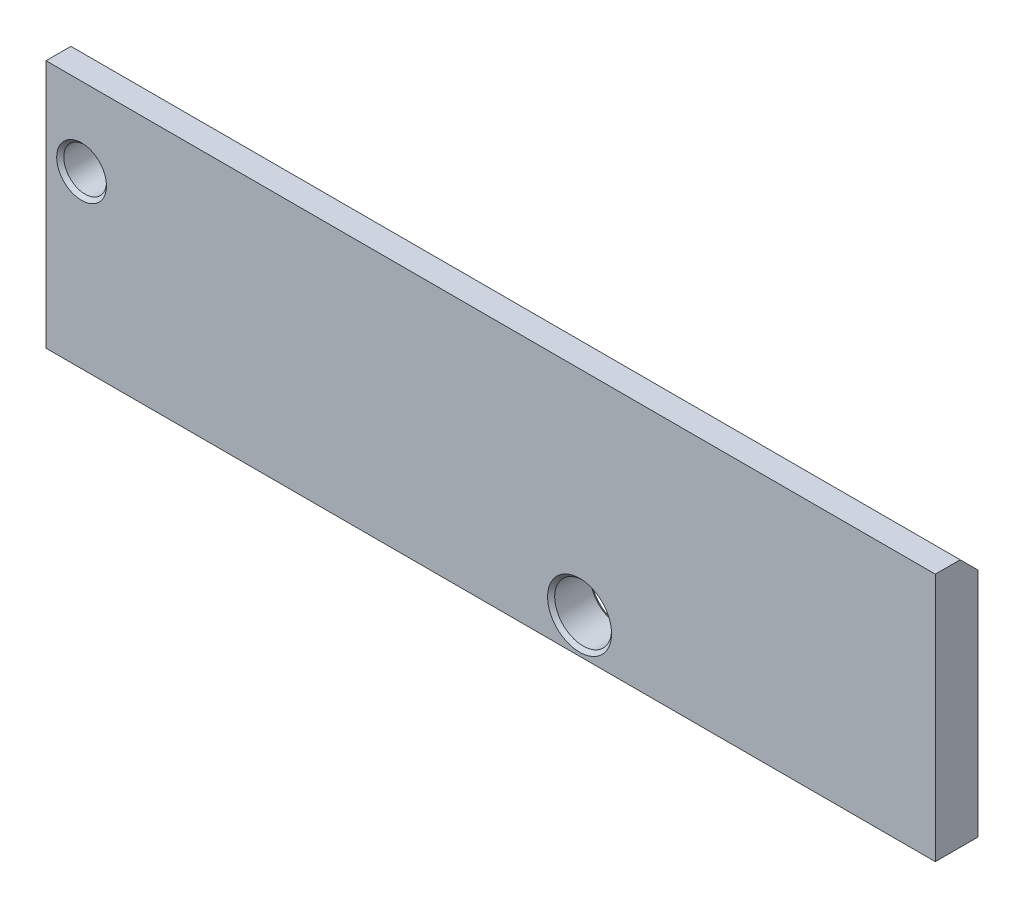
ISO-10303-21;
HEADER;
FILE_DESCRIPTION(('STEP AP214'),'2;1');
FILE_NAME('part.step','',(''),(''),'','','');
FILE_SCHEMA(('AUTOMOTIVE_DESIGN { 1 0 10303 214 1 1 1 1 }'));
ENDSEC;
DATA;
#1=APPLICATION_CONTEXT('core data for automotive mechanical design processes');
#2=APPLICATION_PROTOCOL_DEFINITION('international standard','automotive_design',2000,#1);
#3=PRODUCT_CONTEXT('',#1,'mechanical');
#4=PRODUCT('Part','Part','',(#3));
#5=PRODUCT_RELATED_PRODUCT_CATEGORY('part','',(#4));
#6=PRODUCT_DEFINITION_FORMATION('','',#4);
#7=PRODUCT_DEFINITION_CONTEXT('part definition',#1,'design');
#8=PRODUCT_DEFINITION('design','',#6,#7);
#9=PRODUCT_DEFINITION_SHAPE('','',#8);
#10=(LENGTH_UNIT() NAMED_UNIT(*) SI_UNIT(.MILLI.,.METRE.));
#11=(NAMED_UNIT(*) PLANE_ANGLE_UNIT() SI_UNIT($,.RADIAN.));
#12=(NAMED_UNIT(*) SI_UNIT($,.STERADIAN.) SOLID_ANGLE_UNIT());
#13=UNCERTAINTY_MEASURE_WITH_UNIT(LENGTH_MEASURE(1.E-05),#10,'distance_accuracy_value','');
#14=(GEOMETRIC_REPRESENTATION_CONTEXT(3) GLOBAL_UNCERTAINTY_ASSIGNED_CONTEXT((#13)) GLOBAL_UNIT_ASSIGNED_CONTEXT((#10,
#11,#12)) REPRESENTATION_CONTEXT('',''));
#15=CARTESIAN_POINT('',(0.,0.,0.));
#16=DIRECTION('',(0.,0.,1.));
#17=DIRECTION('',(1.,0.,0.));
#18=AXIS2_PLACEMENT_3D('',#15,#16,#17);
#19=CARTESIAN_POINT('',(100.,-10.,72.));
#20=DIRECTION('',(-1.,0.,0.));
#21=DIRECTION('',(0.,0.,1.));
#22=AXIS2_PLACEMENT_3D('',#19,#20,#21);
#23=PLANE('',#22);
#24=DIRECTION('',(0.,1.,0.));
#25=VECTOR('',#24,1.);
#26=CARTESIAN_POINT('',(100.,-10.,60.));
#27=LINE('',#26,#25);
#28=CARTESIAN_POINT('',(100.,-10.,60.));
#29=VERTEX_POINT('',#28);
#30=CARTESIAN_POINT('',(100.,55.,60.));
#31=VERTEX_POINT('',#30);
#32=EDGE_CURVE('E437',#29,#31,#27,.T.);
#33=ORIENTED_EDGE('',*,*,#32,.T.);
#34=DIRECTION('',(0.,0.70710678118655,0.707106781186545));
#35=VECTOR('',#34,1.);
#36=CARTESIAN_POINT('',(100.,60.,65.));
#37=LINE('',#36,#35);
#38=CARTESIAN_POINT('',(100.,60.,65.));
#39=VERTEX_POINT('',#38);
#40=EDGE_CURVE('E11',#31,#39,#37,.T.);
#41=ORIENTED_EDGE('',*,*,#40,.T.);
#42=DIRECTION('',(0.,0.,-1.));
#43=VECTOR('',#42,1.);
#44=CARTESIAN_POINT('',(100.,60.,72.));
#45=LINE('',#44,#43);
#46=CARTESIAN_POINT('',(100.,60.,72.));
#47=VERTEX_POINT('',#46);
#48=EDGE_CURVE('E460',#47,#39,#45,.T.);
#49=ORIENTED_EDGE('',*,*,#48,.F.);
#50=DIRECTION('',(0.,1.,0.));
#51=VECTOR('',#50,1.);
#52=CARTESIAN_POINT('',(100.,-10.,72.));
#53=LINE('',#52,#51);
#54=CARTESIAN_POINT('',(100.,-10.,72.));
#55=VERTEX_POINT('',#54);
#56=EDGE_CURVE('E443',#55,#47,#53,.T.);
#57=ORIENTED_EDGE('',*,*,#56,.F.);
#58=DIRECTION('',(0.,0.,-1.));
#59=VECTOR('',#58,1.);
#60=CARTESIAN_POINT('',(100.,-10.,72.));
#61=LINE('',#60,#59);
#62=EDGE_CURVE('E452',#55,#29,#61,.T.);
#63=ORIENTED_EDGE('',*,*,#62,.T.);
#64=EDGE_LOOP('',(#33,#41,#49,#57,#63));
#65=FACE_BOUND('',#64,.T.);
#66=ADVANCED_FACE('F368',(#65),#23,.F.);
#67=CARTESIAN_POINT('',(100.,60.,72.));
#68=DIRECTION('',(0.,-1.,0.));
#69=DIRECTION('',(1.,0.,0.));
#70=AXIS2_PLACEMENT_3D('',#67,#68,#69);
#71=PLANE('',#70);
#72=ORIENTED_EDGE('',*,*,#48,.T.);
#73=DIRECTION('',(-1.,0.,0.));
#74=VECTOR('',#73,1.);
#75=CARTESIAN_POINT('',(-150.,60.,65.));
#76=LINE('',#75,#74);
#77=CARTESIAN_POINT('',(-150.,60.,65.));
#78=VERTEX_POINT('',#77);
#79=EDGE_CURVE('E487',#39,#78,#76,.T.);
#80=ORIENTED_EDGE('',*,*,#79,.T.);
#81=DIRECTION('',(0.,0.,-1.));
#82=VECTOR('',#81,1.);
#83=CARTESIAN_POINT('',(-150.,60.,72.));
#84=LINE('',#83,#82);
#85=CARTESIAN_POINT('',(-150.,60.,72.));
#86=VERTEX_POINT('',#85);
#87=EDGE_CURVE('E458',#86,#78,#84,.T.);
#88=ORIENTED_EDGE('',*,*,#87,.F.);
#89=DIRECTION('',(-1.,0.,0.));
#90=VECTOR('',#89,1.);
#91=CARTESIAN_POINT('',(100.,60.,72.));
#92=LINE('',#91,#90);
#93=EDGE_CURVE('E446',#47,#86,#92,.T.);
#94=ORIENTED_EDGE('',*,*,#93,.F.);
#95=EDGE_LOOP('',(#72,#80,#88,#94));
#96=FACE_BOUND('',#95,.T.);
#97=ADVANCED_FACE('F493',(#96),#71,.F.);
#98=CARTESIAN_POINT('',(-150.,60.,72.));
#99=DIRECTION('',(1.,0.,0.));
#100=DIRECTION('',(0.,0.,-1.));
#101=AXIS2_PLACEMENT_3D('',#98,#99,#100);
#102=PLANE('',#101);
#103=ORIENTED_EDGE('',*,*,#87,.T.);
#104=DIRECTION('',(0.,-0.70710678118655,-0.707106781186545));
#105=VECTOR('',#104,1.);
#106=CARTESIAN_POINT('',(-150.,60.,65.));
#107=LINE('',#106,#105);
#108=CARTESIAN_POINT('',(-150.,55.,60.));
#109=VERTEX_POINT('',#108);
#110=EDGE_CURVE('E389',#78,#109,#107,.T.);
#111=ORIENTED_EDGE('',*,*,#110,.T.);
#112=DIRECTION('',(0.,-1.,0.));
#113=VECTOR('',#112,1.);
#114=CARTESIAN_POINT('',(-150.,60.,60.));
#115=LINE('',#114,#113);
#116=CARTESIAN_POINT('',(-150.,-10.,60.));
#117=VERTEX_POINT('',#116);
#118=EDGE_CURVE('E439',#109,#117,#115,.T.);
#119=ORIENTED_EDGE('',*,*,#118,.T.);
#120=DIRECTION('',(0.,0.,-1.));
#121=VECTOR('',#120,1.);
#122=CARTESIAN_POINT('',(-150.,-10.,72.));
#123=LINE('',#122,#121);
#124=CARTESIAN_POINT('',(-150.,-10.,72.));
#125=VERTEX_POINT('',#124);
#126=EDGE_CURVE('E455',#125,#117,#123,.T.);
#127=ORIENTED_EDGE('',*,*,#126,.F.);
#128=DIRECTION('',(0.,-1.,0.));
#129=VECTOR('',#128,1.);
#130=CARTESIAN_POINT('',(-150.,60.,72.));
#131=LINE('',#130,#129);
#132=EDGE_CURVE('E448',#86,#125,#131,.T.);
#133=ORIENTED_EDGE('',*,*,#132,.F.);
#134=EDGE_LOOP('',(#103,#111,#119,#127,#133));
#135=FACE_BOUND('',#134,.T.);
#136=ADVANCED_FACE('F498',(#135),#102,.F.);
#137=CARTESIAN_POINT('',(-150.,-10.,72.));
#138=DIRECTION('',(0.,1.,0.));
#139=DIRECTION('',(-1.,0.,0.));
#140=AXIS2_PLACEMENT_3D('',#137,#138,#139);
#141=PLANE('',#140);
#142=CARTESIAN_POINT('',(80.,-10.,66.));
#143=DIRECTION('',(0.,-1.,0.));
#144=DIRECTION('',(0.,0.,-1.));
#145=AXIS2_PLACEMENT_3D('',#142,#143,#144);
#146=CIRCLE('',#145,2.1);
#147=CARTESIAN_POINT('',(80.,-10.,63.9));
#148=VERTEX_POINT('',#147);
#149=EDGE_CURVE('E426',#148,#148,#146,.T.);
#150=ORIENTED_EDGE('',*,*,#149,.F.);
#151=EDGE_LOOP('',(#150));
#152=FACE_BOUND('',#151,.T.);
#153=CARTESIAN_POINT('',(50.,-10.,66.));
#154=DIRECTION('',(0.,-1.,0.));
#155=DIRECTION('',(0.,0.,-1.));
#156=AXIS2_PLACEMENT_3D('',#153,#154,#155);
#157=CIRCLE('',#156,2.1);
#158=CARTESIAN_POINT('',(50.,-10.,63.9));
#159=VERTEX_POINT('',#158);
#160=EDGE_CURVE('E434',#159,#159,#157,.T.);
#161=ORIENTED_EDGE('',*,*,#160,.F.);
#162=EDGE_LOOP('',(#161));
#163=FACE_BOUND('',#162,.T.);
#164=DIRECTION('',(1.,0.,0.));
#165=VECTOR('',#164,1.);
#166=CARTESIAN_POINT('',(-150.,-10.,60.));
#167=LINE('',#166,#165);
#168=EDGE_CURVE('E441',#117,#29,#167,.T.);
#169=ORIENTED_EDGE('',*,*,#168,.T.);
#170=ORIENTED_EDGE('',*,*,#62,.F.);
#171=DIRECTION('',(1.,0.,0.));
#172=VECTOR('',#171,1.);
#173=CARTESIAN_POINT('',(-150.,-10.,72.));
#174=LINE('',#173,#172);
#175=EDGE_CURVE('E450',#125,#55,#174,.T.);
#176=ORIENTED_EDGE('',*,*,#175,.F.);
#177=ORIENTED_EDGE('',*,*,#126,.T.);
#178=EDGE_LOOP('',(#169,#170,#176,#177));
#179=FACE_BOUND('',#178,.T.);
#180=ADVANCED_FACE('F529',(#152,#163,#179),#141,.F.);
#181=CARTESIAN_POINT('',(100.,-10.,72.));
#182=DIRECTION('',(0.,0.,-1.));
#183=DIRECTION('',(-1.,0.,0.));
#184=AXIS2_PLACEMENT_3D('',#181,#182,#183);
#185=PLANE('',#184);
#186=CARTESIAN_POINT('',(0.,0.,72.));
#187=DIRECTION('',(0.,0.,-1.));
#188=DIRECTION('',(-1.,0.,0.));
#189=AXIS2_PLACEMENT_3D('',#186,#187,#188);
#190=CIRCLE('',#189,9.);
#191=CARTESIAN_POINT('',(-9.,0.,72.));
#192=VERTEX_POINT('',#191);
#193=EDGE_CURVE('E484',#192,#192,#190,.T.);
#194=ORIENTED_EDGE('',*,*,#193,.T.);
#195=EDGE_LOOP('',(#194));
#196=FACE_BOUND('',#195,.T.);
#197=CARTESIAN_POINT('',(-140.,38.,72.));
#198=DIRECTION('',(0.,0.,-1.));
#199=DIRECTION('',(-1.,0.,0.));
#200=AXIS2_PLACEMENT_3D('',#197,#198,#199);
#201=CIRCLE('',#200,7.00000000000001);
#202=CARTESIAN_POINT('',(-147.,38.,72.));
#203=VERTEX_POINT('',#202);
#204=EDGE_CURVE('E481',#203,#203,#201,.T.);
#205=ORIENTED_EDGE('',*,*,#204,.T.);
#206=EDGE_LOOP('',(#205));
#207=FACE_BOUND('',#206,.T.);
#208=ORIENTED_EDGE('',*,*,#56,.T.);
#209=ORIENTED_EDGE('',*,*,#93,.T.);
#210=ORIENTED_EDGE('',*,*,#132,.T.);
#211=ORIENTED_EDGE('',*,*,#175,.T.);
#212=EDGE_LOOP('',(#208,#209,#210,#211));
#213=FACE_BOUND('',#212,.T.);
#214=ADVANCED_FACE('F502',(#196,#207,#213),#185,.F.);
#215=CARTESIAN_POINT('',(100.,-10.,60.));
#216=DIRECTION('',(0.,0.,-1.));
#217=DIRECTION('',(-1.,0.,0.));
#218=AXIS2_PLACEMENT_3D('',#215,#216,#217);
#219=PLANE('',#218);
#220=CARTESIAN_POINT('',(0.,0.,60.));
#221=DIRECTION('',(0.,0.,-1.));
#222=DIRECTION('',(-1.,0.,0.));
#223=AXIS2_PLACEMENT_3D('',#220,#221,#222);
#224=CIRCLE('',#223,9.);
#225=CARTESIAN_POINT('',(-9.,0.,60.));
#226=VERTEX_POINT('',#225);
#227=EDGE_CURVE('E466',#226,#226,#224,.F.);
#228=ORIENTED_EDGE('',*,*,#227,.T.);
#229=EDGE_LOOP('',(#228));
#230=FACE_BOUND('',#229,.T.);
#231=CARTESIAN_POINT('',(-140.,38.,60.));
#232=DIRECTION('',(0.,0.,-1.));
#233=DIRECTION('',(-1.,0.,0.));
#234=AXIS2_PLACEMENT_3D('',#231,#232,#233);
#235=CIRCLE('',#234,7.00000000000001);
#236=CARTESIAN_POINT('',(-147.,38.,60.));
#237=VERTEX_POINT('',#236);
#238=EDGE_CURVE('E463',#237,#237,#235,.F.);
#239=ORIENTED_EDGE('',*,*,#238,.T.);
#240=EDGE_LOOP('',(#239));
#241=FACE_BOUND('',#240,.T.);
#242=ORIENTED_EDGE('',*,*,#118,.F.);
#243=DIRECTION('',(1.,0.,0.));
#244=VECTOR('',#243,1.);
#245=CARTESIAN_POINT('',(100.,55.,60.));
#246=LINE('',#245,#244);
#247=EDGE_CURVE('E375',#109,#31,#246,.T.);
#248=ORIENTED_EDGE('',*,*,#247,.T.);
#249=ORIENTED_EDGE('',*,*,#32,.F.);
#250=ORIENTED_EDGE('',*,*,#168,.F.);
#251=EDGE_LOOP('',(#242,#248,#249,#250));
#252=FACE_BOUND('',#251,.T.);
#253=ADVANCED_FACE('F537',(#230,#241,#252),#219,.T.);
#254=CARTESIAN_POINT('',(0.,0.,59.999));
#255=DIRECTION('',(0.,0.,1.));
#256=DIRECTION('',(1.,0.,0.));
#257=AXIS2_PLACEMENT_3D('',#254,#255,#256);
#258=CYLINDRICAL_SURFACE('',#257,8.);
#259=CARTESIAN_POINT('',(0.,0.,61.));
#260=DIRECTION('',(0.,0.,-1.));
#261=DIRECTION('',(-1.,0.,0.));
#262=AXIS2_PLACEMENT_3D('',#259,#260,#261);
#263=CIRCLE('',#262,8.);
#264=CARTESIAN_POINT('',(-8.,0.,61.));
#265=VERTEX_POINT('',#264);
#266=EDGE_CURVE('E472',#265,#265,#263,.T.);
#267=ORIENTED_EDGE('',*,*,#266,.T.);
#268=EDGE_LOOP('',(#267));
#269=FACE_BOUND('',#268,.T.);
#270=CARTESIAN_POINT('',(0.,0.,71.));
#271=DIRECTION('',(0.,0.,-1.));
#272=DIRECTION('',(-1.,0.,0.));
#273=AXIS2_PLACEMENT_3D('',#270,#271,#272);
#274=CIRCLE('',#273,8.);
#275=CARTESIAN_POINT('',(-8.,0.,71.));
#276=VERTEX_POINT('',#275);
#277=EDGE_CURVE('E469',#276,#276,#274,.F.);
#278=ORIENTED_EDGE('',*,*,#277,.T.);
#279=EDGE_LOOP('',(#278));
#280=FACE_BOUND('',#279,.T.);
#281=ADVANCED_FACE('F541',(#269,#280),#258,.F.);
#282=CARTESIAN_POINT('',(-140.,38.,59.999));
#283=DIRECTION('',(0.,0.,1.));
#284=DIRECTION('',(1.,0.,0.));
#285=AXIS2_PLACEMENT_3D('',#282,#283,#284);
#286=CYLINDRICAL_SURFACE('',#285,6.00000000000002);
#287=CARTESIAN_POINT('',(-140.,38.,61.));
#288=DIRECTION('',(0.,0.,-1.));
#289=DIRECTION('',(-1.,0.,0.));
#290=AXIS2_PLACEMENT_3D('',#287,#288,#289);
#291=CIRCLE('',#290,6.00000000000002);
#292=CARTESIAN_POINT('',(-146.,38.,61.));
#293=VERTEX_POINT('',#292);
#294=EDGE_CURVE('E478',#293,#293,#291,.T.);
#295=ORIENTED_EDGE('',*,*,#294,.T.);
#296=EDGE_LOOP('',(#295));
#297=FACE_BOUND('',#296,.T.);
#298=CARTESIAN_POINT('',(-140.,38.,71.));
#299=DIRECTION('',(0.,0.,-1.));
#300=DIRECTION('',(-1.,0.,0.));
#301=AXIS2_PLACEMENT_3D('',#298,#299,#300);
#302=CIRCLE('',#301,6.00000000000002);
#303=CARTESIAN_POINT('',(-146.,38.,71.));
#304=VERTEX_POINT('',#303);
#305=EDGE_CURVE('E475',#304,#304,#302,.F.);
#306=ORIENTED_EDGE('',*,*,#305,.T.);
#307=EDGE_LOOP('',(#306));
#308=FACE_BOUND('',#307,.T.);
#309=ADVANCED_FACE('F545',(#297,#308),#286,.F.);
#310=CARTESIAN_POINT('',(0.,0.,60.));
#311=DIRECTION('',(0.,0.,-1.));
#312=DIRECTION('',(-1.,0.,0.));
#313=AXIS2_PLACEMENT_3D('',#310,#311,#312);
#314=CONICAL_SURFACE('',#313,9.,0.785398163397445);
#315=ORIENTED_EDGE('',*,*,#266,.F.);
#316=EDGE_LOOP('',(#315));
#317=FACE_BOUND('',#316,.T.);
#318=ORIENTED_EDGE('',*,*,#227,.F.);
#319=EDGE_LOOP('',(#318));
#320=FACE_BOUND('',#319,.T.);
#321=ADVANCED_FACE('F549',(#317,#320),#314,.F.);
#322=CARTESIAN_POINT('',(-140.,38.,60.));
#323=DIRECTION('',(0.,0.,-1.));
#324=DIRECTION('',(-1.,0.,0.));
#325=AXIS2_PLACEMENT_3D('',#322,#323,#324);
#326=CONICAL_SURFACE('',#325,7.00000000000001,0.78539816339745);
#327=ORIENTED_EDGE('',*,*,#294,.F.);
#328=EDGE_LOOP('',(#327));
#329=FACE_BOUND('',#328,.T.);
#330=ORIENTED_EDGE('',*,*,#238,.F.);
#331=EDGE_LOOP('',(#330));
#332=FACE_BOUND('',#331,.T.);
#333=ADVANCED_FACE('F553',(#329,#332),#326,.F.);
#334=CARTESIAN_POINT('',(0.,0.,71.));
#335=DIRECTION('',(0.,0.,1.));
#336=DIRECTION('',(1.,0.,0.));
#337=AXIS2_PLACEMENT_3D('',#334,#335,#336);
#338=CONICAL_SURFACE('',#337,8.,0.785398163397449);
#339=ORIENTED_EDGE('',*,*,#193,.F.);
#340=EDGE_LOOP('',(#339));
#341=FACE_BOUND('',#340,.T.);
#342=ORIENTED_EDGE('',*,*,#277,.F.);
#343=EDGE_LOOP('',(#342));
#344=FACE_BOUND('',#343,.T.);
#345=ADVANCED_FACE('F519',(#341,#344),#338,.F.);
#346=CARTESIAN_POINT('',(-140.,38.,71.));
#347=DIRECTION('',(0.,0.,1.));
#348=DIRECTION('',(1.,0.,0.));
#349=AXIS2_PLACEMENT_3D('',#346,#347,#348);
#350=CONICAL_SURFACE('',#349,6.00000000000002,0.785398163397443);
#351=ORIENTED_EDGE('',*,*,#204,.F.);
#352=EDGE_LOOP('',(#351));
#353=FACE_BOUND('',#352,.T.);
#354=ORIENTED_EDGE('',*,*,#305,.F.);
#355=EDGE_LOOP('',(#354));
#356=FACE_BOUND('',#355,.T.);
#357=ADVANCED_FACE('F509',(#353,#356),#350,.F.);
#358=CARTESIAN_POINT('',(100.,60.,65.));
#359=DIRECTION('',(0.,0.707106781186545,-0.70710678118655));
#360=DIRECTION('',(0.,0.70710678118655,0.707106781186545));
#361=AXIS2_PLACEMENT_3D('',#358,#359,#360);
#362=PLANE('',#361);
#363=ORIENTED_EDGE('',*,*,#40,.F.);
#364=ORIENTED_EDGE('',*,*,#247,.F.);
#365=ORIENTED_EDGE('',*,*,#110,.F.);
#366=ORIENTED_EDGE('',*,*,#79,.F.);
#367=EDGE_LOOP('',(#363,#364,#365,#366));
#368=FACE_BOUND('',#367,.T.);
#369=ADVANCED_FACE('F506',(#368),#362,.T.);
#370=CARTESIAN_POINT('',(50.,-10.,66.));
#371=DIRECTION('',(0.,-1.,0.));
#372=DIRECTION('',(0.,0.,-1.));
#373=AXIS2_PLACEMENT_3D('',#370,#371,#372);
#374=CYLINDRICAL_SURFACE('',#373,2.1);
#375=CARTESIAN_POINT('',(50.,2.39999999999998,66.));
#376=DIRECTION('',(0.,-1.,0.));
#377=DIRECTION('',(0.,0.,-1.));
#378=AXIS2_PLACEMENT_3D('',#375,#376,#377);
#379=CIRCLE('',#378,2.1);
#380=CARTESIAN_POINT('',(50.,2.39999999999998,63.9));
#381=VERTEX_POINT('',#380);
#382=EDGE_CURVE('E429',#381,#381,#379,.T.);
#383=ORIENTED_EDGE('',*,*,#382,.F.);
#384=EDGE_LOOP('',(#383));
#385=FACE_BOUND('',#384,.T.);
#386=ORIENTED_EDGE('',*,*,#160,.T.);
#387=EDGE_LOOP('',(#386));
#388=FACE_BOUND('',#387,.T.);
#389=ADVANCED_FACE('F508',(#385,#388),#374,.F.);
#390=CARTESIAN_POINT('',(50.,2.39999999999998,66.));
#391=DIRECTION('',(0.,-1.,0.));
#392=DIRECTION('',(0.,0.,-1.));
#393=AXIS2_PLACEMENT_3D('',#390,#391,#392);
#394=CONICAL_SURFACE('',#393,2.1,1.02974425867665);
#395=CARTESIAN_POINT('',(50.,3.66180729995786,66.));
#396=VERTEX_POINT('',#395);
#397=VERTEX_LOOP('',#396);
#398=FACE_BOUND('',#397,.T.);
#399=ORIENTED_EDGE('',*,*,#382,.T.);
#400=EDGE_LOOP('',(#399));
#401=FACE_BOUND('',#400,.T.);
#402=ADVANCED_FACE('F516',(#398,#401),#394,.F.);
#403=CARTESIAN_POINT('',(80.,-10.,66.));
#404=DIRECTION('',(0.,-1.,0.));
#405=DIRECTION('',(0.,0.,-1.));
#406=AXIS2_PLACEMENT_3D('',#403,#404,#405);
#407=CYLINDRICAL_SURFACE('',#406,2.1);
#408=CARTESIAN_POINT('',(80.,2.39999999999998,66.));
#409=DIRECTION('',(0.,-1.,0.));
#410=DIRECTION('',(0.,0.,-1.));
#411=AXIS2_PLACEMENT_3D('',#408,#409,#410);
#412=CIRCLE('',#411,2.09999999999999);
#413=CARTESIAN_POINT('',(80.,2.39999999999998,63.9));
#414=VERTEX_POINT('',#413);
#415=EDGE_CURVE('E424',#414,#414,#412,.T.);
#416=ORIENTED_EDGE('',*,*,#415,.F.);
#417=EDGE_LOOP('',(#416));
#418=FACE_BOUND('',#417,.T.);
#419=ORIENTED_EDGE('',*,*,#149,.T.);
#420=EDGE_LOOP('',(#419));
#421=FACE_BOUND('',#420,.T.);
#422=ADVANCED_FACE('F420',(#418,#421),#407,.F.);
#423=CARTESIAN_POINT('',(80.,2.39999999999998,66.));
#424=DIRECTION('',(0.,-1.,0.));
#425=DIRECTION('',(0.,0.,-1.));
#426=AXIS2_PLACEMENT_3D('',#423,#424,#425);
#427=CONICAL_SURFACE('',#426,2.09999999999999,1.02974425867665);
#428=CARTESIAN_POINT('',(80.,3.66180729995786,66.));
#429=VERTEX_POINT('',#428);
#430=VERTEX_LOOP('',#429);
#431=FACE_BOUND('',#430,.T.);
#432=ORIENTED_EDGE('',*,*,#415,.T.);
#433=EDGE_LOOP('',(#432));
#434=FACE_BOUND('',#433,.T.);
#435=ADVANCED_FACE('F417',(#431,#434),#427,.F.);
#436=CLOSED_SHELL('',(#66,#97,#136,#180,#214,#253,#281,#309,#321,#333,#345,#357,#369,#389,#402,
#422,#435));
#437=MANIFOLD_SOLID_BREP('B2',#436);
#438=ADVANCED_BREP_SHAPE_REPRESENTATION('',(#18,#437),#14);
#439=SHAPE_DEFINITION_REPRESENTATION(#9,#438);
ENDSEC;
END-ISO-10303-21;
